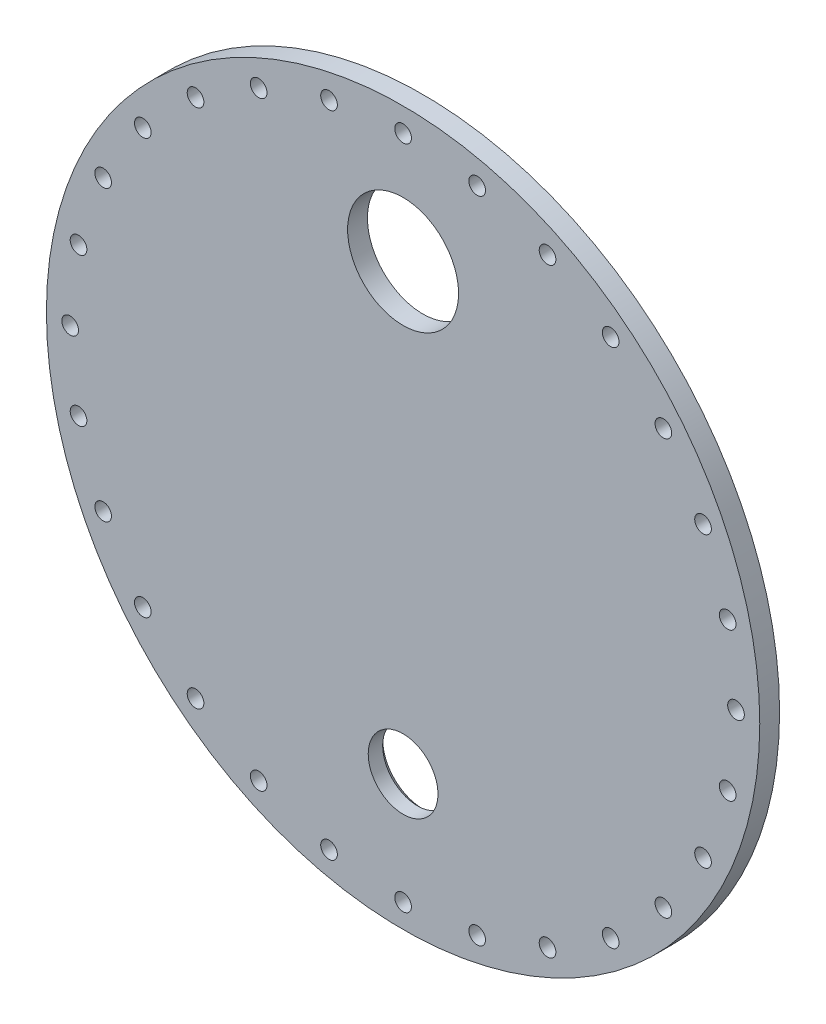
ISO-10303-21;
HEADER;
FILE_DESCRIPTION(('STEP AP214'),'2;1');
FILE_NAME('part.step','',(''),(''),'','','');
FILE_SCHEMA(('AUTOMOTIVE_DESIGN { 1 0 10303 214 1 1 1 1 }'));
ENDSEC;
DATA;
#1=APPLICATION_CONTEXT('core data for automotive mechanical design processes');
#2=APPLICATION_PROTOCOL_DEFINITION('international standard','automotive_design',2000,#1);
#3=PRODUCT_CONTEXT('',#1,'mechanical');
#4=PRODUCT('Part','Part','',(#3));
#5=PRODUCT_RELATED_PRODUCT_CATEGORY('part','',(#4));
#6=PRODUCT_DEFINITION_FORMATION('','',#4);
#7=PRODUCT_DEFINITION_CONTEXT('part definition',#1,'design');
#8=PRODUCT_DEFINITION('design','',#6,#7);
#9=PRODUCT_DEFINITION_SHAPE('','',#8);
#10=(LENGTH_UNIT() NAMED_UNIT(*) SI_UNIT(.MILLI.,.METRE.));
#11=(NAMED_UNIT(*) PLANE_ANGLE_UNIT() SI_UNIT($,.RADIAN.));
#12=(NAMED_UNIT(*) SI_UNIT($,.STERADIAN.) SOLID_ANGLE_UNIT());
#13=UNCERTAINTY_MEASURE_WITH_UNIT(LENGTH_MEASURE(1.E-05),#10,'distance_accuracy_value','');
#14=(GEOMETRIC_REPRESENTATION_CONTEXT(3) GLOBAL_UNCERTAINTY_ASSIGNED_CONTEXT((#13)) GLOBAL_UNIT_ASSIGNED_CONTEXT((#10,
#11,#12)) REPRESENTATION_CONTEXT('',''));
#15=CARTESIAN_POINT('',(0.,0.,0.));
#16=DIRECTION('',(0.,0.,1.));
#17=DIRECTION('',(1.,0.,0.));
#18=AXIS2_PLACEMENT_3D('',#15,#16,#17);
#19=CARTESIAN_POINT('',(0.,0.,12.5));
#20=DIRECTION('',(0.,0.,1.));
#21=DIRECTION('',(1.,0.,0.));
#22=AXIS2_PLACEMENT_3D('',#19,#20,#21);
#23=PLANE('',#22);
#24=CARTESIAN_POINT('',(0.,0.,12.5));
#25=DIRECTION('',(0.,0.,1.));
#26=DIRECTION('',(1.,0.,0.));
#27=AXIS2_PLACEMENT_3D('',#24,#25,#26);
#28=CIRCLE('',#27,225.);
#29=CARTESIAN_POINT('',(225.,0.,12.5));
#30=VERTEX_POINT('',#29);
#31=EDGE_CURVE('E10',#30,#30,#28,.T.);
#32=ORIENTED_EDGE('',*,*,#31,.T.);
#33=EDGE_LOOP('',(#32));
#34=FACE_BOUND('',#33,.T.);
#35=CARTESIAN_POINT('',(0.,210.,12.5));
#36=DIRECTION('',(0.,0.,1.));
#37=DIRECTION('',(1.,0.,0.));
#38=AXIS2_PLACEMENT_3D('',#35,#36,#37);
#39=CIRCLE('',#38,5.25);
#40=CARTESIAN_POINT('',(5.25,210.,12.5));
#41=VERTEX_POINT('',#40);
#42=EDGE_CURVE('E41',#41,#41,#39,.T.);
#43=ORIENTED_EDGE('',*,*,#42,.F.);
#44=EDGE_LOOP('',(#43));
#45=FACE_BOUND('',#44,.T.);
#46=CARTESIAN_POINT('',(-46.7293961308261,204.734861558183,12.5));
#47=DIRECTION('',(0.,0.,1.));
#48=DIRECTION('',(0.974927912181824,0.222520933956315,0.));
#49=AXIS2_PLACEMENT_3D('',#46,#47,#48);
#50=CIRCLE('',#49,5.25);
#51=CARTESIAN_POINT('',(-41.6110245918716,205.903096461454,12.5));
#52=VERTEX_POINT('',#51);
#53=EDGE_CURVE('E47',#52,#52,#50,.T.);
#54=ORIENTED_EDGE('',*,*,#53,.F.);
#55=EDGE_LOOP('',(#54));
#56=FACE_BOUND('',#55,.T.);
#57=CARTESIAN_POINT('',(-91.1155852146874,189.203462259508,12.5));
#58=DIRECTION('',(0.,0.,1.));
#59=DIRECTION('',(0.900968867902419,0.433883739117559,0.));
#60=AXIS2_PLACEMENT_3D('',#57,#58,#59);
#61=CIRCLE('',#60,5.25);
#62=CARTESIAN_POINT('',(-86.3854986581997,191.481351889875,12.5));
#63=VERTEX_POINT('',#62);
#64=EDGE_CURVE('E53',#63,#63,#61,.T.);
#65=ORIENTED_EDGE('',*,*,#64,.F.);
#66=EDGE_LOOP('',(#65));
#67=FACE_BOUND('',#66,.T.);
#68=CARTESIAN_POINT('',(-130.932858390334,164.184611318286,12.5));
#69=DIRECTION('',(0.,0.,1.));
#70=DIRECTION('',(0.781831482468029,0.623489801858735,0.));
#71=AXIS2_PLACEMENT_3D('',#68,#69,#70);
#72=CIRCLE('',#71,5.25);
#73=CARTESIAN_POINT('',(-126.828243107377,167.457932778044,12.5));
#74=VERTEX_POINT('',#73);
#75=EDGE_CURVE('E59',#74,#74,#72,.T.);
#76=ORIENTED_EDGE('',*,*,#75,.F.);
#77=EDGE_LOOP('',(#76));
#78=FACE_BOUND('',#77,.T.);
#79=CARTESIAN_POINT('',(-164.184611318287,130.932858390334,12.5));
#80=DIRECTION('',(0.,0.,1.));
#81=DIRECTION('',(0.623489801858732,0.781831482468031,0.));
#82=AXIS2_PLACEMENT_3D('',#79,#80,#81);
#83=CIRCLE('',#82,5.25);
#84=CARTESIAN_POINT('',(-160.911289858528,135.037473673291,12.5));
#85=VERTEX_POINT('',#84);
#86=EDGE_CURVE('E65',#85,#85,#83,.T.);
#87=ORIENTED_EDGE('',*,*,#86,.F.);
#88=EDGE_LOOP('',(#87));
#89=FACE_BOUND('',#88,.T.);
#90=CARTESIAN_POINT('',(-189.203462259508,91.1155852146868,12.5));
#91=DIRECTION('',(0.,0.,1.));
#92=DIRECTION('',(0.433883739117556,0.90096886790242,0.));
#93=AXIS2_PLACEMENT_3D('',#90,#91,#92);
#94=CIRCLE('',#93,5.25);
#95=CARTESIAN_POINT('',(-186.925572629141,95.8456717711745,12.5));
#96=VERTEX_POINT('',#95);
#97=EDGE_CURVE('E71',#96,#96,#94,.T.);
#98=ORIENTED_EDGE('',*,*,#97,.F.);
#99=EDGE_LOOP('',(#98));
#100=FACE_BOUND('',#99,.T.);
#101=CARTESIAN_POINT('',(-204.734861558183,46.7293961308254,12.5));
#102=DIRECTION('',(0.,0.,1.));
#103=DIRECTION('',(0.222520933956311,0.974927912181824,0.));
#104=AXIS2_PLACEMENT_3D('',#101,#102,#103);
#105=CIRCLE('',#104,5.25);
#106=CARTESIAN_POINT('',(-203.566626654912,51.84776766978,12.5));
#107=VERTEX_POINT('',#106);
#108=EDGE_CURVE('E77',#107,#107,#105,.T.);
#109=ORIENTED_EDGE('',*,*,#108,.F.);
#110=EDGE_LOOP('',(#109));
#111=FACE_BOUND('',#110,.T.);
#112=CARTESIAN_POINT('',(-210.,-7.33211081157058E-13,12.5));
#113=DIRECTION('',(0.,0.,1.));
#114=DIRECTION('',(0.,1.,0.));
#115=AXIS2_PLACEMENT_3D('',#112,#113,#114);
#116=CIRCLE('',#115,5.25);
#117=CARTESIAN_POINT('',(-210.,5.24999999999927,12.5));
#118=VERTEX_POINT('',#117);
#119=EDGE_CURVE('E83',#118,#118,#116,.T.);
#120=ORIENTED_EDGE('',*,*,#119,.F.);
#121=EDGE_LOOP('',(#120));
#122=FACE_BOUND('',#121,.T.);
#123=CARTESIAN_POINT('',(-204.734861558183,-46.7293961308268,12.5));
#124=DIRECTION('',(0.,0.,1.));
#125=DIRECTION('',(-0.222520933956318,0.974927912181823,0.));
#126=AXIS2_PLACEMENT_3D('',#123,#124,#125);
#127=CIRCLE('',#126,5.25);
#128=CARTESIAN_POINT('',(-205.903096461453,-41.6110245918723,12.5));
#129=VERTEX_POINT('',#128);
#130=EDGE_CURVE('E89',#129,#129,#127,.T.);
#131=ORIENTED_EDGE('',*,*,#130,.F.);
#132=EDGE_LOOP('',(#131));
#133=FACE_BOUND('',#132,.T.);
#134=CARTESIAN_POINT('',(-189.203462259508,-91.115585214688,12.5));
#135=DIRECTION('',(0.,0.,1.));
#136=DIRECTION('',(-0.433883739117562,0.900968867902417,0.));
#137=AXIS2_PLACEMENT_3D('',#134,#135,#136);
#138=CIRCLE('',#137,5.25);
#139=CARTESIAN_POINT('',(-191.481351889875,-86.3854986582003,12.5));
#140=VERTEX_POINT('',#139);
#141=EDGE_CURVE('E95',#140,#140,#138,.T.);
#142=ORIENTED_EDGE('',*,*,#141,.F.);
#143=EDGE_LOOP('',(#142));
#144=FACE_BOUND('',#143,.T.);
#145=CARTESIAN_POINT('',(-164.184611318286,-130.932858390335,12.5));
#146=DIRECTION('',(0.,0.,1.));
#147=DIRECTION('',(-0.623489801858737,0.781831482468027,0.));
#148=AXIS2_PLACEMENT_3D('',#145,#146,#147);
#149=CIRCLE('',#148,5.25);
#150=CARTESIAN_POINT('',(-167.457932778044,-126.828243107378,12.5));
#151=VERTEX_POINT('',#150);
#152=EDGE_CURVE('E101',#151,#151,#149,.T.);
#153=ORIENTED_EDGE('',*,*,#152,.F.);
#154=EDGE_LOOP('',(#153));
#155=FACE_BOUND('',#154,.T.);
#156=CARTESIAN_POINT('',(-130.932858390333,-164.184611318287,12.5));
#157=DIRECTION('',(0.,0.,1.));
#158=DIRECTION('',(-0.781831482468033,0.623489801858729,0.));
#159=AXIS2_PLACEMENT_3D('',#156,#157,#158);
#160=CIRCLE('',#159,5.25);
#161=CARTESIAN_POINT('',(-135.03747367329,-160.911289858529,12.5));
#162=VERTEX_POINT('',#161);
#163=EDGE_CURVE('E107',#162,#162,#160,.T.);
#164=ORIENTED_EDGE('',*,*,#163,.F.);
#165=EDGE_LOOP('',(#164));
#166=FACE_BOUND('',#165,.T.);
#167=CARTESIAN_POINT('',(-91.115585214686,-189.203462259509,12.5));
#168=DIRECTION('',(0.,0.,1.));
#169=DIRECTION('',(-0.900968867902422,0.433883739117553,0.));
#170=AXIS2_PLACEMENT_3D('',#167,#168,#169);
#171=CIRCLE('',#170,5.25);
#172=CARTESIAN_POINT('',(-95.8456717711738,-186.925572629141,12.5));
#173=VERTEX_POINT('',#172);
#174=EDGE_CURVE('E113',#173,#173,#171,.T.);
#175=ORIENTED_EDGE('',*,*,#174,.F.);
#176=EDGE_LOOP('',(#175));
#177=FACE_BOUND('',#176,.T.);
#178=CARTESIAN_POINT('',(-46.7293961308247,-204.734861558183,12.5));
#179=DIRECTION('',(0.,0.,1.));
#180=DIRECTION('',(-0.974927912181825,0.222520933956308,0.));
#181=AXIS2_PLACEMENT_3D('',#178,#179,#180);
#182=CIRCLE('',#181,5.25);
#183=CARTESIAN_POINT('',(-51.8477676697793,-203.566626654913,12.5));
#184=VERTEX_POINT('',#183);
#185=EDGE_CURVE('E119',#184,#184,#182,.T.);
#186=ORIENTED_EDGE('',*,*,#185,.F.);
#187=EDGE_LOOP('',(#186));
#188=FACE_BOUND('',#187,.T.);
#189=CARTESIAN_POINT('',(0.,-210.,12.5));
#190=DIRECTION('',(0.,0.,1.));
#191=DIRECTION('',(-1.,0.,0.));
#192=AXIS2_PLACEMENT_3D('',#189,#190,#191);
#193=CIRCLE('',#192,5.25);
#194=CARTESIAN_POINT('',(-5.25,-210.,12.5));
#195=VERTEX_POINT('',#194);
#196=EDGE_CURVE('E125',#195,#195,#193,.T.);
#197=ORIENTED_EDGE('',*,*,#196,.F.);
#198=EDGE_LOOP('',(#197));
#199=FACE_BOUND('',#198,.T.);
#200=CARTESIAN_POINT('',(46.7293961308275,-204.734861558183,12.5));
#201=DIRECTION('',(0.,0.,1.));
#202=DIRECTION('',(-0.974927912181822,-0.222520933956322,0.));
#203=AXIS2_PLACEMENT_3D('',#200,#201,#202);
#204=CIRCLE('',#203,5.25);
#205=CARTESIAN_POINT('',(41.611024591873,-205.903096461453,12.5));
#206=VERTEX_POINT('',#205);
#207=EDGE_CURVE('E131',#206,#206,#204,.T.);
#208=ORIENTED_EDGE('',*,*,#207,.F.);
#209=EDGE_LOOP('',(#208));
#210=FACE_BOUND('',#209,.T.);
#211=CARTESIAN_POINT('',(91.1155852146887,-189.203462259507,12.5));
#212=DIRECTION('',(0.,0.,1.));
#213=DIRECTION('',(-0.900968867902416,-0.433883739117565,0.));
#214=AXIS2_PLACEMENT_3D('',#211,#212,#213);
#215=CIRCLE('',#214,5.25);
#216=CARTESIAN_POINT('',(86.385498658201,-191.481351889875,12.5));
#217=VERTEX_POINT('',#216);
#218=EDGE_CURVE('E137',#217,#217,#215,.T.);
#219=ORIENTED_EDGE('',*,*,#218,.F.);
#220=EDGE_LOOP('',(#219));
#221=FACE_BOUND('',#220,.T.);
#222=CARTESIAN_POINT('',(130.932858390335,-164.184611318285,12.5));
#223=DIRECTION('',(0.,0.,1.));
#224=DIRECTION('',(-0.781831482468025,-0.62348980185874,0.));
#225=AXIS2_PLACEMENT_3D('',#222,#223,#224);
#226=CIRCLE('',#225,5.25);
#227=CARTESIAN_POINT('',(126.828243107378,-167.457932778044,12.5));
#228=VERTEX_POINT('',#227);
#229=EDGE_CURVE('E143',#228,#228,#226,.T.);
#230=ORIENTED_EDGE('',*,*,#229,.F.);
#231=EDGE_LOOP('',(#230));
#232=FACE_BOUND('',#231,.T.);
#233=CARTESIAN_POINT('',(164.184611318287,-130.932858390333,12.5));
#234=DIRECTION('',(0.,0.,1.));
#235=DIRECTION('',(-0.623489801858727,-0.781831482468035,0.));
#236=AXIS2_PLACEMENT_3D('',#233,#234,#235);
#237=CIRCLE('',#236,5.25);
#238=CARTESIAN_POINT('',(160.911289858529,-135.03747367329,12.5));
#239=VERTEX_POINT('',#238);
#240=EDGE_CURVE('E149',#239,#239,#237,.T.);
#241=ORIENTED_EDGE('',*,*,#240,.F.);
#242=EDGE_LOOP('',(#241));
#243=FACE_BOUND('',#242,.T.);
#244=CARTESIAN_POINT('',(189.203462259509,-91.1155852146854,12.5));
#245=DIRECTION('',(0.,0.,1.));
#246=DIRECTION('',(-0.433883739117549,-0.900968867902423,0.));
#247=AXIS2_PLACEMENT_3D('',#244,#245,#246);
#248=CIRCLE('',#247,5.25);
#249=CARTESIAN_POINT('',(186.925572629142,-95.8456717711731,12.5));
#250=VERTEX_POINT('',#249);
#251=EDGE_CURVE('E155',#250,#250,#248,.T.);
#252=ORIENTED_EDGE('',*,*,#251,.F.);
#253=EDGE_LOOP('',(#252));
#254=FACE_BOUND('',#253,.T.);
#255=CARTESIAN_POINT('',(204.734861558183,-46.7293961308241,12.5));
#256=DIRECTION('',(0.,0.,1.));
#257=DIRECTION('',(-0.222520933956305,-0.974927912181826,0.));
#258=AXIS2_PLACEMENT_3D('',#255,#256,#257);
#259=CIRCLE('',#258,5.25);
#260=CARTESIAN_POINT('',(203.566626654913,-51.8477676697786,12.5));
#261=VERTEX_POINT('',#260);
#262=EDGE_CURVE('E161',#261,#261,#259,.T.);
#263=ORIENTED_EDGE('',*,*,#262,.F.);
#264=EDGE_LOOP('',(#263));
#265=FACE_BOUND('',#264,.T.);
#266=CARTESIAN_POINT('',(210.,2.19963324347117E-12,12.5));
#267=DIRECTION('',(0.,0.,1.));
#268=DIRECTION('',(0.,-1.,0.));
#269=AXIS2_PLACEMENT_3D('',#266,#267,#268);
#270=CIRCLE('',#269,5.25);
#271=CARTESIAN_POINT('',(210.,-5.2499999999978,12.5));
#272=VERTEX_POINT('',#271);
#273=EDGE_CURVE('E167',#272,#272,#270,.T.);
#274=ORIENTED_EDGE('',*,*,#273,.F.);
#275=EDGE_LOOP('',(#274));
#276=FACE_BOUND('',#275,.T.);
#277=CARTESIAN_POINT('',(204.734861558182,46.7293961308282,12.5));
#278=DIRECTION('',(0.,0.,1.));
#279=DIRECTION('',(0.222520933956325,-0.974927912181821,0.));
#280=AXIS2_PLACEMENT_3D('',#277,#278,#279);
#281=CIRCLE('',#280,5.25);
#282=CARTESIAN_POINT('',(205.903096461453,41.6110245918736,12.5));
#283=VERTEX_POINT('',#282);
#284=EDGE_CURVE('E173',#283,#283,#281,.T.);
#285=ORIENTED_EDGE('',*,*,#284,.F.);
#286=EDGE_LOOP('',(#285));
#287=FACE_BOUND('',#286,.T.);
#288=CARTESIAN_POINT('',(189.203462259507,91.1155852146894,12.5));
#289=DIRECTION('',(0.,0.,1.));
#290=DIRECTION('',(0.433883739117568,-0.900968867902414,0.));
#291=AXIS2_PLACEMENT_3D('',#288,#289,#290);
#292=CIRCLE('',#291,5.25);
#293=CARTESIAN_POINT('',(191.481351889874,86.3854986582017,12.5));
#294=VERTEX_POINT('',#293);
#295=EDGE_CURVE('E179',#294,#294,#292,.T.);
#296=ORIENTED_EDGE('',*,*,#295,.F.);
#297=EDGE_LOOP('',(#296));
#298=FACE_BOUND('',#297,.T.);
#299=CARTESIAN_POINT('',(164.184611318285,130.932858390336,12.5));
#300=DIRECTION('',(0.,0.,1.));
#301=DIRECTION('',(0.623489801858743,-0.781831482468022,0.));
#302=AXIS2_PLACEMENT_3D('',#299,#300,#301);
#303=CIRCLE('',#302,5.25);
#304=CARTESIAN_POINT('',(167.457932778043,126.828243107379,12.5));
#305=VERTEX_POINT('',#304);
#306=EDGE_CURVE('E185',#305,#305,#303,.T.);
#307=ORIENTED_EDGE('',*,*,#306,.F.);
#308=EDGE_LOOP('',(#307));
#309=FACE_BOUND('',#308,.T.);
#310=CARTESIAN_POINT('',(130.932858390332,164.184611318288,12.5));
#311=DIRECTION('',(0.,0.,1.));
#312=DIRECTION('',(0.781831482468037,-0.623489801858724,0.));
#313=AXIS2_PLACEMENT_3D('',#310,#311,#312);
#314=CIRCLE('',#313,5.25);
#315=CARTESIAN_POINT('',(135.037473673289,160.91128985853,12.5));
#316=VERTEX_POINT('',#315);
#317=EDGE_CURVE('E191',#316,#316,#314,.T.);
#318=ORIENTED_EDGE('',*,*,#317,.F.);
#319=EDGE_LOOP('',(#318));
#320=FACE_BOUND('',#319,.T.);
#321=CARTESIAN_POINT('',(91.1155852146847,189.203462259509,12.5));
#322=DIRECTION('',(0.,0.,1.));
#323=DIRECTION('',(0.900968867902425,-0.433883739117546,0.));
#324=AXIS2_PLACEMENT_3D('',#321,#322,#323);
#325=CIRCLE('',#324,5.25);
#326=CARTESIAN_POINT('',(95.8456717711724,186.925572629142,12.5));
#327=VERTEX_POINT('',#326);
#328=EDGE_CURVE('E197',#327,#327,#325,.T.);
#329=ORIENTED_EDGE('',*,*,#328,.F.);
#330=EDGE_LOOP('',(#329));
#331=FACE_BOUND('',#330,.T.);
#332=CARTESIAN_POINT('',(46.7293961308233,204.734861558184,12.5));
#333=DIRECTION('',(0.,0.,1.));
#334=DIRECTION('',(0.974927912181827,-0.222520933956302,0.));
#335=AXIS2_PLACEMENT_3D('',#332,#333,#334);
#336=CIRCLE('',#335,5.25);
#337=CARTESIAN_POINT('',(51.8477676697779,203.566626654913,12.5));
#338=VERTEX_POINT('',#337);
#339=EDGE_CURVE('E203',#338,#338,#336,.T.);
#340=ORIENTED_EDGE('',*,*,#339,.F.);
#341=EDGE_LOOP('',(#340));
#342=FACE_BOUND('',#341,.T.);
#343=CARTESIAN_POINT('',(0.,140.,12.5));
#344=DIRECTION('',(0.,0.,1.));
#345=DIRECTION('',(1.,0.,0.));
#346=AXIS2_PLACEMENT_3D('',#343,#344,#345);
#347=CIRCLE('',#346,35.);
#348=CARTESIAN_POINT('',(35.,140.,12.5));
#349=VERTEX_POINT('',#348);
#350=EDGE_CURVE('E209',#349,#349,#347,.T.);
#351=ORIENTED_EDGE('',*,*,#350,.F.);
#352=EDGE_LOOP('',(#351));
#353=FACE_BOUND('',#352,.T.);
#354=CARTESIAN_POINT('',(0.,-140.,12.5));
#355=DIRECTION('',(0.,0.,-1.));
#356=DIRECTION('',(-1.,0.,0.));
#357=AXIS2_PLACEMENT_3D('',#354,#355,#356);
#358=CIRCLE('',#357,22.);
#359=CARTESIAN_POINT('',(-22.,-140.,12.5));
#360=VERTEX_POINT('',#359);
#361=EDGE_CURVE('E212',#360,#360,#358,.T.);
#362=ORIENTED_EDGE('',*,*,#361,.T.);
#363=EDGE_LOOP('',(#362));
#364=FACE_BOUND('',#363,.T.);
#365=ADVANCED_FACE('F28',(#34,#45,#56,#67,#78,#89,#100,#111,#122,#133,#144,#155,#166,#177,#188,
#199,#210,#221,#232,#243,#254,#265,#276,#287,#298,#309,#320,#331,#342,#353,#364),#23,.T.);
#366=CARTESIAN_POINT('',(0.,0.,12.5));
#367=DIRECTION('',(0.,0.,-1.));
#368=DIRECTION('',(-1.,0.,0.));
#369=AXIS2_PLACEMENT_3D('',#366,#367,#368);
#370=CYLINDRICAL_SURFACE('',#369,225.);
#371=ORIENTED_EDGE('',*,*,#31,.F.);
#372=EDGE_LOOP('',(#371));
#373=FACE_BOUND('',#372,.T.);
#374=CARTESIAN_POINT('',(0.,0.,0.));
#375=DIRECTION('',(0.,0.,1.));
#376=DIRECTION('',(1.,0.,0.));
#377=AXIS2_PLACEMENT_3D('',#374,#375,#376);
#378=CIRCLE('',#377,225.);
#379=CARTESIAN_POINT('',(225.,0.,0.));
#380=VERTEX_POINT('',#379);
#381=EDGE_CURVE('E32',#380,#380,#378,.T.);
#382=ORIENTED_EDGE('',*,*,#381,.T.);
#383=EDGE_LOOP('',(#382));
#384=FACE_BOUND('',#383,.T.);
#385=ADVANCED_FACE('F30',(#373,#384),#370,.T.);
#386=CARTESIAN_POINT('',(0.,0.,0.));
#387=DIRECTION('',(0.,0.,1.));
#388=DIRECTION('',(1.,0.,0.));
#389=AXIS2_PLACEMENT_3D('',#386,#387,#388);
#390=PLANE('',#389);
#391=CARTESIAN_POINT('',(0.,-140.,0.));
#392=DIRECTION('',(0.,0.,-1.));
#393=DIRECTION('',(-1.,0.,0.));
#394=AXIS2_PLACEMENT_3D('',#391,#392,#393);
#395=CIRCLE('',#394,25.4);
#396=CARTESIAN_POINT('',(-25.4,-140.,0.));
#397=VERTEX_POINT('',#396);
#398=EDGE_CURVE('E220',#397,#397,#395,.T.);
#399=ORIENTED_EDGE('',*,*,#398,.F.);
#400=EDGE_LOOP('',(#399));
#401=FACE_BOUND('',#400,.T.);
#402=CARTESIAN_POINT('',(0.,140.,0.));
#403=DIRECTION('',(0.,0.,1.));
#404=DIRECTION('',(1.,0.,0.));
#405=AXIS2_PLACEMENT_3D('',#402,#403,#404);
#406=CIRCLE('',#405,35.);
#407=CARTESIAN_POINT('',(35.,140.,0.));
#408=VERTEX_POINT('',#407);
#409=EDGE_CURVE('E206',#408,#408,#406,.T.);
#410=ORIENTED_EDGE('',*,*,#409,.T.);
#411=EDGE_LOOP('',(#410));
#412=FACE_BOUND('',#411,.T.);
#413=CARTESIAN_POINT('',(46.7293961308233,204.734861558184,0.));
#414=DIRECTION('',(0.,0.,1.));
#415=DIRECTION('',(0.974927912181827,-0.222520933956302,0.));
#416=AXIS2_PLACEMENT_3D('',#413,#414,#415);
#417=CIRCLE('',#416,5.25);
#418=CARTESIAN_POINT('',(51.8477676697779,203.566626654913,0.));
#419=VERTEX_POINT('',#418);
#420=EDGE_CURVE('E200',#419,#419,#417,.T.);
#421=ORIENTED_EDGE('',*,*,#420,.T.);
#422=EDGE_LOOP('',(#421));
#423=FACE_BOUND('',#422,.T.);
#424=CARTESIAN_POINT('',(91.1155852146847,189.203462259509,0.));
#425=DIRECTION('',(0.,0.,1.));
#426=DIRECTION('',(0.900968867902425,-0.433883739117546,0.));
#427=AXIS2_PLACEMENT_3D('',#424,#425,#426);
#428=CIRCLE('',#427,5.25);
#429=CARTESIAN_POINT('',(95.8456717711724,186.925572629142,0.));
#430=VERTEX_POINT('',#429);
#431=EDGE_CURVE('E194',#430,#430,#428,.T.);
#432=ORIENTED_EDGE('',*,*,#431,.T.);
#433=EDGE_LOOP('',(#432));
#434=FACE_BOUND('',#433,.T.);
#435=CARTESIAN_POINT('',(130.932858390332,164.184611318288,0.));
#436=DIRECTION('',(0.,0.,1.));
#437=DIRECTION('',(0.781831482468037,-0.623489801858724,0.));
#438=AXIS2_PLACEMENT_3D('',#435,#436,#437);
#439=CIRCLE('',#438,5.25);
#440=CARTESIAN_POINT('',(135.037473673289,160.91128985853,0.));
#441=VERTEX_POINT('',#440);
#442=EDGE_CURVE('E188',#441,#441,#439,.T.);
#443=ORIENTED_EDGE('',*,*,#442,.T.);
#444=EDGE_LOOP('',(#443));
#445=FACE_BOUND('',#444,.T.);
#446=CARTESIAN_POINT('',(164.184611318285,130.932858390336,0.));
#447=DIRECTION('',(0.,0.,1.));
#448=DIRECTION('',(0.623489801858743,-0.781831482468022,0.));
#449=AXIS2_PLACEMENT_3D('',#446,#447,#448);
#450=CIRCLE('',#449,5.25);
#451=CARTESIAN_POINT('',(167.457932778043,126.828243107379,0.));
#452=VERTEX_POINT('',#451);
#453=EDGE_CURVE('E182',#452,#452,#450,.T.);
#454=ORIENTED_EDGE('',*,*,#453,.T.);
#455=EDGE_LOOP('',(#454));
#456=FACE_BOUND('',#455,.T.);
#457=CARTESIAN_POINT('',(189.203462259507,91.1155852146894,0.));
#458=DIRECTION('',(0.,0.,1.));
#459=DIRECTION('',(0.433883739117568,-0.900968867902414,0.));
#460=AXIS2_PLACEMENT_3D('',#457,#458,#459);
#461=CIRCLE('',#460,5.25);
#462=CARTESIAN_POINT('',(191.481351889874,86.3854986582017,0.));
#463=VERTEX_POINT('',#462);
#464=EDGE_CURVE('E176',#463,#463,#461,.T.);
#465=ORIENTED_EDGE('',*,*,#464,.T.);
#466=EDGE_LOOP('',(#465));
#467=FACE_BOUND('',#466,.T.);
#468=CARTESIAN_POINT('',(204.734861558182,46.7293961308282,0.));
#469=DIRECTION('',(0.,0.,1.));
#470=DIRECTION('',(0.222520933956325,-0.974927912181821,0.));
#471=AXIS2_PLACEMENT_3D('',#468,#469,#470);
#472=CIRCLE('',#471,5.25);
#473=CARTESIAN_POINT('',(205.903096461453,41.6110245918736,0.));
#474=VERTEX_POINT('',#473);
#475=EDGE_CURVE('E170',#474,#474,#472,.T.);
#476=ORIENTED_EDGE('',*,*,#475,.T.);
#477=EDGE_LOOP('',(#476));
#478=FACE_BOUND('',#477,.T.);
#479=CARTESIAN_POINT('',(210.,2.19963324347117E-12,0.));
#480=DIRECTION('',(0.,0.,1.));
#481=DIRECTION('',(0.,-1.,0.));
#482=AXIS2_PLACEMENT_3D('',#479,#480,#481);
#483=CIRCLE('',#482,5.25);
#484=CARTESIAN_POINT('',(210.,-5.2499999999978,0.));
#485=VERTEX_POINT('',#484);
#486=EDGE_CURVE('E164',#485,#485,#483,.T.);
#487=ORIENTED_EDGE('',*,*,#486,.T.);
#488=EDGE_LOOP('',(#487));
#489=FACE_BOUND('',#488,.T.);
#490=CARTESIAN_POINT('',(204.734861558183,-46.7293961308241,0.));
#491=DIRECTION('',(0.,0.,1.));
#492=DIRECTION('',(-0.222520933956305,-0.974927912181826,0.));
#493=AXIS2_PLACEMENT_3D('',#490,#491,#492);
#494=CIRCLE('',#493,5.25);
#495=CARTESIAN_POINT('',(203.566626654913,-51.8477676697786,0.));
#496=VERTEX_POINT('',#495);
#497=EDGE_CURVE('E158',#496,#496,#494,.T.);
#498=ORIENTED_EDGE('',*,*,#497,.T.);
#499=EDGE_LOOP('',(#498));
#500=FACE_BOUND('',#499,.T.);
#501=CARTESIAN_POINT('',(189.203462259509,-91.1155852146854,0.));
#502=DIRECTION('',(0.,0.,1.));
#503=DIRECTION('',(-0.433883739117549,-0.900968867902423,0.));
#504=AXIS2_PLACEMENT_3D('',#501,#502,#503);
#505=CIRCLE('',#504,5.25);
#506=CARTESIAN_POINT('',(186.925572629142,-95.8456717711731,0.));
#507=VERTEX_POINT('',#506);
#508=EDGE_CURVE('E152',#507,#507,#505,.T.);
#509=ORIENTED_EDGE('',*,*,#508,.T.);
#510=EDGE_LOOP('',(#509));
#511=FACE_BOUND('',#510,.T.);
#512=CARTESIAN_POINT('',(164.184611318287,-130.932858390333,0.));
#513=DIRECTION('',(0.,0.,1.));
#514=DIRECTION('',(-0.623489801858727,-0.781831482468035,0.));
#515=AXIS2_PLACEMENT_3D('',#512,#513,#514);
#516=CIRCLE('',#515,5.25);
#517=CARTESIAN_POINT('',(160.911289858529,-135.03747367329,0.));
#518=VERTEX_POINT('',#517);
#519=EDGE_CURVE('E146',#518,#518,#516,.T.);
#520=ORIENTED_EDGE('',*,*,#519,.T.);
#521=EDGE_LOOP('',(#520));
#522=FACE_BOUND('',#521,.T.);
#523=CARTESIAN_POINT('',(130.932858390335,-164.184611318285,0.));
#524=DIRECTION('',(0.,0.,1.));
#525=DIRECTION('',(-0.781831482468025,-0.62348980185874,0.));
#526=AXIS2_PLACEMENT_3D('',#523,#524,#525);
#527=CIRCLE('',#526,5.25);
#528=CARTESIAN_POINT('',(126.828243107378,-167.457932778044,0.));
#529=VERTEX_POINT('',#528);
#530=EDGE_CURVE('E140',#529,#529,#527,.T.);
#531=ORIENTED_EDGE('',*,*,#530,.T.);
#532=EDGE_LOOP('',(#531));
#533=FACE_BOUND('',#532,.T.);
#534=CARTESIAN_POINT('',(91.1155852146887,-189.203462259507,0.));
#535=DIRECTION('',(0.,0.,1.));
#536=DIRECTION('',(-0.900968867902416,-0.433883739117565,0.));
#537=AXIS2_PLACEMENT_3D('',#534,#535,#536);
#538=CIRCLE('',#537,5.25);
#539=CARTESIAN_POINT('',(86.385498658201,-191.481351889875,0.));
#540=VERTEX_POINT('',#539);
#541=EDGE_CURVE('E134',#540,#540,#538,.T.);
#542=ORIENTED_EDGE('',*,*,#541,.T.);
#543=EDGE_LOOP('',(#542));
#544=FACE_BOUND('',#543,.T.);
#545=CARTESIAN_POINT('',(46.7293961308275,-204.734861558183,0.));
#546=DIRECTION('',(0.,0.,1.));
#547=DIRECTION('',(-0.974927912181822,-0.222520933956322,0.));
#548=AXIS2_PLACEMENT_3D('',#545,#546,#547);
#549=CIRCLE('',#548,5.25);
#550=CARTESIAN_POINT('',(41.611024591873,-205.903096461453,0.));
#551=VERTEX_POINT('',#550);
#552=EDGE_CURVE('E128',#551,#551,#549,.T.);
#553=ORIENTED_EDGE('',*,*,#552,.T.);
#554=EDGE_LOOP('',(#553));
#555=FACE_BOUND('',#554,.T.);
#556=CARTESIAN_POINT('',(0.,-210.,0.));
#557=DIRECTION('',(0.,0.,1.));
#558=DIRECTION('',(-1.,0.,0.));
#559=AXIS2_PLACEMENT_3D('',#556,#557,#558);
#560=CIRCLE('',#559,5.25);
#561=CARTESIAN_POINT('',(-5.25,-210.,0.));
#562=VERTEX_POINT('',#561);
#563=EDGE_CURVE('E122',#562,#562,#560,.T.);
#564=ORIENTED_EDGE('',*,*,#563,.T.);
#565=EDGE_LOOP('',(#564));
#566=FACE_BOUND('',#565,.T.);
#567=CARTESIAN_POINT('',(-46.7293961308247,-204.734861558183,0.));
#568=DIRECTION('',(0.,0.,1.));
#569=DIRECTION('',(-0.974927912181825,0.222520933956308,0.));
#570=AXIS2_PLACEMENT_3D('',#567,#568,#569);
#571=CIRCLE('',#570,5.25);
#572=CARTESIAN_POINT('',(-51.8477676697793,-203.566626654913,0.));
#573=VERTEX_POINT('',#572);
#574=EDGE_CURVE('E116',#573,#573,#571,.T.);
#575=ORIENTED_EDGE('',*,*,#574,.T.);
#576=EDGE_LOOP('',(#575));
#577=FACE_BOUND('',#576,.T.);
#578=CARTESIAN_POINT('',(-91.115585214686,-189.203462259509,0.));
#579=DIRECTION('',(0.,0.,1.));
#580=DIRECTION('',(-0.900968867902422,0.433883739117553,0.));
#581=AXIS2_PLACEMENT_3D('',#578,#579,#580);
#582=CIRCLE('',#581,5.25);
#583=CARTESIAN_POINT('',(-95.8456717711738,-186.925572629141,0.));
#584=VERTEX_POINT('',#583);
#585=EDGE_CURVE('E110',#584,#584,#582,.T.);
#586=ORIENTED_EDGE('',*,*,#585,.T.);
#587=EDGE_LOOP('',(#586));
#588=FACE_BOUND('',#587,.T.);
#589=CARTESIAN_POINT('',(-130.932858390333,-164.184611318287,0.));
#590=DIRECTION('',(0.,0.,1.));
#591=DIRECTION('',(-0.781831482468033,0.623489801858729,0.));
#592=AXIS2_PLACEMENT_3D('',#589,#590,#591);
#593=CIRCLE('',#592,5.25);
#594=CARTESIAN_POINT('',(-135.03747367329,-160.911289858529,0.));
#595=VERTEX_POINT('',#594);
#596=EDGE_CURVE('E104',#595,#595,#593,.T.);
#597=ORIENTED_EDGE('',*,*,#596,.T.);
#598=EDGE_LOOP('',(#597));
#599=FACE_BOUND('',#598,.T.);
#600=CARTESIAN_POINT('',(-164.184611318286,-130.932858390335,0.));
#601=DIRECTION('',(0.,0.,1.));
#602=DIRECTION('',(-0.623489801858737,0.781831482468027,0.));
#603=AXIS2_PLACEMENT_3D('',#600,#601,#602);
#604=CIRCLE('',#603,5.25);
#605=CARTESIAN_POINT('',(-167.457932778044,-126.828243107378,0.));
#606=VERTEX_POINT('',#605);
#607=EDGE_CURVE('E98',#606,#606,#604,.T.);
#608=ORIENTED_EDGE('',*,*,#607,.T.);
#609=EDGE_LOOP('',(#608));
#610=FACE_BOUND('',#609,.T.);
#611=CARTESIAN_POINT('',(-189.203462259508,-91.115585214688,0.));
#612=DIRECTION('',(0.,0.,1.));
#613=DIRECTION('',(-0.433883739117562,0.900968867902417,0.));
#614=AXIS2_PLACEMENT_3D('',#611,#612,#613);
#615=CIRCLE('',#614,5.25);
#616=CARTESIAN_POINT('',(-191.481351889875,-86.3854986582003,0.));
#617=VERTEX_POINT('',#616);
#618=EDGE_CURVE('E92',#617,#617,#615,.T.);
#619=ORIENTED_EDGE('',*,*,#618,.T.);
#620=EDGE_LOOP('',(#619));
#621=FACE_BOUND('',#620,.T.);
#622=CARTESIAN_POINT('',(-204.734861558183,-46.7293961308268,0.));
#623=DIRECTION('',(0.,0.,1.));
#624=DIRECTION('',(-0.222520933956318,0.974927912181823,0.));
#625=AXIS2_PLACEMENT_3D('',#622,#623,#624);
#626=CIRCLE('',#625,5.25);
#627=CARTESIAN_POINT('',(-205.903096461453,-41.6110245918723,0.));
#628=VERTEX_POINT('',#627);
#629=EDGE_CURVE('E86',#628,#628,#626,.T.);
#630=ORIENTED_EDGE('',*,*,#629,.T.);
#631=EDGE_LOOP('',(#630));
#632=FACE_BOUND('',#631,.T.);
#633=CARTESIAN_POINT('',(-210.,-7.33211081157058E-13,0.));
#634=DIRECTION('',(0.,0.,1.));
#635=DIRECTION('',(0.,1.,0.));
#636=AXIS2_PLACEMENT_3D('',#633,#634,#635);
#637=CIRCLE('',#636,5.25);
#638=CARTESIAN_POINT('',(-210.,5.24999999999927,0.));
#639=VERTEX_POINT('',#638);
#640=EDGE_CURVE('E80',#639,#639,#637,.T.);
#641=ORIENTED_EDGE('',*,*,#640,.T.);
#642=EDGE_LOOP('',(#641));
#643=FACE_BOUND('',#642,.T.);
#644=CARTESIAN_POINT('',(-204.734861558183,46.7293961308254,0.));
#645=DIRECTION('',(0.,0.,1.));
#646=DIRECTION('',(0.222520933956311,0.974927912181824,0.));
#647=AXIS2_PLACEMENT_3D('',#644,#645,#646);
#648=CIRCLE('',#647,5.25);
#649=CARTESIAN_POINT('',(-203.566626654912,51.84776766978,0.));
#650=VERTEX_POINT('',#649);
#651=EDGE_CURVE('E74',#650,#650,#648,.T.);
#652=ORIENTED_EDGE('',*,*,#651,.T.);
#653=EDGE_LOOP('',(#652));
#654=FACE_BOUND('',#653,.T.);
#655=CARTESIAN_POINT('',(-189.203462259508,91.1155852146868,0.));
#656=DIRECTION('',(0.,0.,1.));
#657=DIRECTION('',(0.433883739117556,0.90096886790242,0.));
#658=AXIS2_PLACEMENT_3D('',#655,#656,#657);
#659=CIRCLE('',#658,5.25);
#660=CARTESIAN_POINT('',(-186.925572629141,95.8456717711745,0.));
#661=VERTEX_POINT('',#660);
#662=EDGE_CURVE('E68',#661,#661,#659,.T.);
#663=ORIENTED_EDGE('',*,*,#662,.T.);
#664=EDGE_LOOP('',(#663));
#665=FACE_BOUND('',#664,.T.);
#666=CARTESIAN_POINT('',(-164.184611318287,130.932858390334,0.));
#667=DIRECTION('',(0.,0.,1.));
#668=DIRECTION('',(0.623489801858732,0.781831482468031,0.));
#669=AXIS2_PLACEMENT_3D('',#666,#667,#668);
#670=CIRCLE('',#669,5.25);
#671=CARTESIAN_POINT('',(-160.911289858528,135.037473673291,0.));
#672=VERTEX_POINT('',#671);
#673=EDGE_CURVE('E62',#672,#672,#670,.T.);
#674=ORIENTED_EDGE('',*,*,#673,.T.);
#675=EDGE_LOOP('',(#674));
#676=FACE_BOUND('',#675,.T.);
#677=CARTESIAN_POINT('',(-130.932858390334,164.184611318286,0.));
#678=DIRECTION('',(0.,0.,1.));
#679=DIRECTION('',(0.781831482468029,0.623489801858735,0.));
#680=AXIS2_PLACEMENT_3D('',#677,#678,#679);
#681=CIRCLE('',#680,5.25);
#682=CARTESIAN_POINT('',(-126.828243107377,167.457932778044,0.));
#683=VERTEX_POINT('',#682);
#684=EDGE_CURVE('E56',#683,#683,#681,.T.);
#685=ORIENTED_EDGE('',*,*,#684,.T.);
#686=EDGE_LOOP('',(#685));
#687=FACE_BOUND('',#686,.T.);
#688=CARTESIAN_POINT('',(-91.1155852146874,189.203462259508,0.));
#689=DIRECTION('',(0.,0.,1.));
#690=DIRECTION('',(0.900968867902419,0.433883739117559,0.));
#691=AXIS2_PLACEMENT_3D('',#688,#689,#690);
#692=CIRCLE('',#691,5.25);
#693=CARTESIAN_POINT('',(-86.3854986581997,191.481351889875,0.));
#694=VERTEX_POINT('',#693);
#695=EDGE_CURVE('E50',#694,#694,#692,.T.);
#696=ORIENTED_EDGE('',*,*,#695,.T.);
#697=EDGE_LOOP('',(#696));
#698=FACE_BOUND('',#697,.T.);
#699=CARTESIAN_POINT('',(-46.7293961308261,204.734861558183,0.));
#700=DIRECTION('',(0.,0.,1.));
#701=DIRECTION('',(0.974927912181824,0.222520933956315,0.));
#702=AXIS2_PLACEMENT_3D('',#699,#700,#701);
#703=CIRCLE('',#702,5.25);
#704=CARTESIAN_POINT('',(-41.6110245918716,205.903096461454,0.));
#705=VERTEX_POINT('',#704);
#706=EDGE_CURVE('E44',#705,#705,#703,.T.);
#707=ORIENTED_EDGE('',*,*,#706,.T.);
#708=EDGE_LOOP('',(#707));
#709=FACE_BOUND('',#708,.T.);
#710=CARTESIAN_POINT('',(0.,210.,0.));
#711=DIRECTION('',(0.,0.,1.));
#712=DIRECTION('',(1.,0.,0.));
#713=AXIS2_PLACEMENT_3D('',#710,#711,#712);
#714=CIRCLE('',#713,5.25);
#715=CARTESIAN_POINT('',(5.25,210.,0.));
#716=VERTEX_POINT('',#715);
#717=EDGE_CURVE('E39',#716,#716,#714,.T.);
#718=ORIENTED_EDGE('',*,*,#717,.T.);
#719=EDGE_LOOP('',(#718));
#720=FACE_BOUND('',#719,.T.);
#721=ORIENTED_EDGE('',*,*,#381,.F.);
#722=EDGE_LOOP('',(#721));
#723=FACE_BOUND('',#722,.T.);
#724=ADVANCED_FACE('F226',(#401,#412,#423,#434,#445,#456,#467,#478,#489,#500,#511,#522,#533,
#544,#555,#566,#577,#588,#599,#610,#621,#632,#643,#654,#665,#676,#687,#698,#709,#720,#723),#390,.F.);
#725=CARTESIAN_POINT('',(0.,210.,0.));
#726=DIRECTION('',(0.,0.,1.));
#727=DIRECTION('',(1.,0.,0.));
#728=AXIS2_PLACEMENT_3D('',#725,#726,#727);
#729=CYLINDRICAL_SURFACE('',#728,5.25);
#730=ORIENTED_EDGE('',*,*,#717,.F.);
#731=EDGE_LOOP('',(#730));
#732=FACE_BOUND('',#731,.T.);
#733=ORIENTED_EDGE('',*,*,#42,.T.);
#734=EDGE_LOOP('',(#733));
#735=FACE_BOUND('',#734,.T.);
#736=ADVANCED_FACE('F229',(#732,#735),#729,.F.);
#737=CARTESIAN_POINT('',(-46.7293961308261,204.734861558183,0.));
#738=DIRECTION('',(0.,0.,1.));
#739=DIRECTION('',(1.,0.,0.));
#740=AXIS2_PLACEMENT_3D('',#737,#738,#739);
#741=CYLINDRICAL_SURFACE('',#740,5.25);
#742=ORIENTED_EDGE('',*,*,#706,.F.);
#743=EDGE_LOOP('',(#742));
#744=FACE_BOUND('',#743,.T.);
#745=ORIENTED_EDGE('',*,*,#53,.T.);
#746=EDGE_LOOP('',(#745));
#747=FACE_BOUND('',#746,.T.);
#748=ADVANCED_FACE('F302',(#744,#747),#741,.F.);
#749=CARTESIAN_POINT('',(-91.1155852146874,189.203462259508,0.));
#750=DIRECTION('',(0.,0.,1.));
#751=DIRECTION('',(1.,0.,0.));
#752=AXIS2_PLACEMENT_3D('',#749,#750,#751);
#753=CYLINDRICAL_SURFACE('',#752,5.25);
#754=ORIENTED_EDGE('',*,*,#695,.F.);
#755=EDGE_LOOP('',(#754));
#756=FACE_BOUND('',#755,.T.);
#757=ORIENTED_EDGE('',*,*,#64,.T.);
#758=EDGE_LOOP('',(#757));
#759=FACE_BOUND('',#758,.T.);
#760=ADVANCED_FACE('F306',(#756,#759),#753,.F.);
#761=CARTESIAN_POINT('',(-130.932858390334,164.184611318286,0.));
#762=DIRECTION('',(0.,0.,1.));
#763=DIRECTION('',(1.,0.,0.));
#764=AXIS2_PLACEMENT_3D('',#761,#762,#763);
#765=CYLINDRICAL_SURFACE('',#764,5.25);
#766=ORIENTED_EDGE('',*,*,#684,.F.);
#767=EDGE_LOOP('',(#766));
#768=FACE_BOUND('',#767,.T.);
#769=ORIENTED_EDGE('',*,*,#75,.T.);
#770=EDGE_LOOP('',(#769));
#771=FACE_BOUND('',#770,.T.);
#772=ADVANCED_FACE('F310',(#768,#771),#765,.F.);
#773=CARTESIAN_POINT('',(-164.184611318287,130.932858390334,0.));
#774=DIRECTION('',(0.,0.,1.));
#775=DIRECTION('',(1.,0.,0.));
#776=AXIS2_PLACEMENT_3D('',#773,#774,#775);
#777=CYLINDRICAL_SURFACE('',#776,5.25);
#778=ORIENTED_EDGE('',*,*,#673,.F.);
#779=EDGE_LOOP('',(#778));
#780=FACE_BOUND('',#779,.T.);
#781=ORIENTED_EDGE('',*,*,#86,.T.);
#782=EDGE_LOOP('',(#781));
#783=FACE_BOUND('',#782,.T.);
#784=ADVANCED_FACE('F314',(#780,#783),#777,.F.);
#785=CARTESIAN_POINT('',(-189.203462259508,91.1155852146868,0.));
#786=DIRECTION('',(0.,0.,1.));
#787=DIRECTION('',(1.,0.,0.));
#788=AXIS2_PLACEMENT_3D('',#785,#786,#787);
#789=CYLINDRICAL_SURFACE('',#788,5.25);
#790=ORIENTED_EDGE('',*,*,#662,.F.);
#791=EDGE_LOOP('',(#790));
#792=FACE_BOUND('',#791,.T.);
#793=ORIENTED_EDGE('',*,*,#97,.T.);
#794=EDGE_LOOP('',(#793));
#795=FACE_BOUND('',#794,.T.);
#796=ADVANCED_FACE('F318',(#792,#795),#789,.F.);
#797=CARTESIAN_POINT('',(-204.734861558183,46.7293961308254,0.));
#798=DIRECTION('',(0.,0.,1.));
#799=DIRECTION('',(1.,0.,0.));
#800=AXIS2_PLACEMENT_3D('',#797,#798,#799);
#801=CYLINDRICAL_SURFACE('',#800,5.25);
#802=ORIENTED_EDGE('',*,*,#651,.F.);
#803=EDGE_LOOP('',(#802));
#804=FACE_BOUND('',#803,.T.);
#805=ORIENTED_EDGE('',*,*,#108,.T.);
#806=EDGE_LOOP('',(#805));
#807=FACE_BOUND('',#806,.T.);
#808=ADVANCED_FACE('F322',(#804,#807),#801,.F.);
#809=CARTESIAN_POINT('',(-210.,-7.33211081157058E-13,0.));
#810=DIRECTION('',(0.,0.,1.));
#811=DIRECTION('',(1.,0.,0.));
#812=AXIS2_PLACEMENT_3D('',#809,#810,#811);
#813=CYLINDRICAL_SURFACE('',#812,5.25);
#814=ORIENTED_EDGE('',*,*,#640,.F.);
#815=EDGE_LOOP('',(#814));
#816=FACE_BOUND('',#815,.T.);
#817=ORIENTED_EDGE('',*,*,#119,.T.);
#818=EDGE_LOOP('',(#817));
#819=FACE_BOUND('',#818,.T.);
#820=ADVANCED_FACE('F326',(#816,#819),#813,.F.);
#821=CARTESIAN_POINT('',(-204.734861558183,-46.7293961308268,0.));
#822=DIRECTION('',(0.,0.,1.));
#823=DIRECTION('',(1.,0.,0.));
#824=AXIS2_PLACEMENT_3D('',#821,#822,#823);
#825=CYLINDRICAL_SURFACE('',#824,5.25);
#826=ORIENTED_EDGE('',*,*,#629,.F.);
#827=EDGE_LOOP('',(#826));
#828=FACE_BOUND('',#827,.T.);
#829=ORIENTED_EDGE('',*,*,#130,.T.);
#830=EDGE_LOOP('',(#829));
#831=FACE_BOUND('',#830,.T.);
#832=ADVANCED_FACE('F330',(#828,#831),#825,.F.);
#833=CARTESIAN_POINT('',(-189.203462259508,-91.115585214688,0.));
#834=DIRECTION('',(0.,0.,1.));
#835=DIRECTION('',(1.,0.,0.));
#836=AXIS2_PLACEMENT_3D('',#833,#834,#835);
#837=CYLINDRICAL_SURFACE('',#836,5.25);
#838=ORIENTED_EDGE('',*,*,#618,.F.);
#839=EDGE_LOOP('',(#838));
#840=FACE_BOUND('',#839,.T.);
#841=ORIENTED_EDGE('',*,*,#141,.T.);
#842=EDGE_LOOP('',(#841));
#843=FACE_BOUND('',#842,.T.);
#844=ADVANCED_FACE('F334',(#840,#843),#837,.F.);
#845=CARTESIAN_POINT('',(-164.184611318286,-130.932858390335,0.));
#846=DIRECTION('',(0.,0.,1.));
#847=DIRECTION('',(1.,0.,0.));
#848=AXIS2_PLACEMENT_3D('',#845,#846,#847);
#849=CYLINDRICAL_SURFACE('',#848,5.25);
#850=ORIENTED_EDGE('',*,*,#607,.F.);
#851=EDGE_LOOP('',(#850));
#852=FACE_BOUND('',#851,.T.);
#853=ORIENTED_EDGE('',*,*,#152,.T.);
#854=EDGE_LOOP('',(#853));
#855=FACE_BOUND('',#854,.T.);
#856=ADVANCED_FACE('F338',(#852,#855),#849,.F.);
#857=CARTESIAN_POINT('',(-130.932858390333,-164.184611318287,0.));
#858=DIRECTION('',(0.,0.,1.));
#859=DIRECTION('',(1.,0.,0.));
#860=AXIS2_PLACEMENT_3D('',#857,#858,#859);
#861=CYLINDRICAL_SURFACE('',#860,5.25);
#862=ORIENTED_EDGE('',*,*,#596,.F.);
#863=EDGE_LOOP('',(#862));
#864=FACE_BOUND('',#863,.T.);
#865=ORIENTED_EDGE('',*,*,#163,.T.);
#866=EDGE_LOOP('',(#865));
#867=FACE_BOUND('',#866,.T.);
#868=ADVANCED_FACE('F342',(#864,#867),#861,.F.);
#869=CARTESIAN_POINT('',(-91.115585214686,-189.203462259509,0.));
#870=DIRECTION('',(0.,0.,1.));
#871=DIRECTION('',(1.,0.,0.));
#872=AXIS2_PLACEMENT_3D('',#869,#870,#871);
#873=CYLINDRICAL_SURFACE('',#872,5.25);
#874=ORIENTED_EDGE('',*,*,#585,.F.);
#875=EDGE_LOOP('',(#874));
#876=FACE_BOUND('',#875,.T.);
#877=ORIENTED_EDGE('',*,*,#174,.T.);
#878=EDGE_LOOP('',(#877));
#879=FACE_BOUND('',#878,.T.);
#880=ADVANCED_FACE('F346',(#876,#879),#873,.F.);
#881=CARTESIAN_POINT('',(-46.7293961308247,-204.734861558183,0.));
#882=DIRECTION('',(0.,0.,1.));
#883=DIRECTION('',(1.,0.,0.));
#884=AXIS2_PLACEMENT_3D('',#881,#882,#883);
#885=CYLINDRICAL_SURFACE('',#884,5.25);
#886=ORIENTED_EDGE('',*,*,#574,.F.);
#887=EDGE_LOOP('',(#886));
#888=FACE_BOUND('',#887,.T.);
#889=ORIENTED_EDGE('',*,*,#185,.T.);
#890=EDGE_LOOP('',(#889));
#891=FACE_BOUND('',#890,.T.);
#892=ADVANCED_FACE('F350',(#888,#891),#885,.F.);
#893=CARTESIAN_POINT('',(0.,-210.,0.));
#894=DIRECTION('',(0.,0.,1.));
#895=DIRECTION('',(1.,0.,0.));
#896=AXIS2_PLACEMENT_3D('',#893,#894,#895);
#897=CYLINDRICAL_SURFACE('',#896,5.25);
#898=ORIENTED_EDGE('',*,*,#563,.F.);
#899=EDGE_LOOP('',(#898));
#900=FACE_BOUND('',#899,.T.);
#901=ORIENTED_EDGE('',*,*,#196,.T.);
#902=EDGE_LOOP('',(#901));
#903=FACE_BOUND('',#902,.T.);
#904=ADVANCED_FACE('F354',(#900,#903),#897,.F.);
#905=CARTESIAN_POINT('',(46.7293961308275,-204.734861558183,0.));
#906=DIRECTION('',(0.,0.,1.));
#907=DIRECTION('',(1.,0.,0.));
#908=AXIS2_PLACEMENT_3D('',#905,#906,#907);
#909=CYLINDRICAL_SURFACE('',#908,5.25);
#910=ORIENTED_EDGE('',*,*,#552,.F.);
#911=EDGE_LOOP('',(#910));
#912=FACE_BOUND('',#911,.T.);
#913=ORIENTED_EDGE('',*,*,#207,.T.);
#914=EDGE_LOOP('',(#913));
#915=FACE_BOUND('',#914,.T.);
#916=ADVANCED_FACE('F358',(#912,#915),#909,.F.);
#917=CARTESIAN_POINT('',(91.1155852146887,-189.203462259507,0.));
#918=DIRECTION('',(0.,0.,1.));
#919=DIRECTION('',(1.,0.,0.));
#920=AXIS2_PLACEMENT_3D('',#917,#918,#919);
#921=CYLINDRICAL_SURFACE('',#920,5.25);
#922=ORIENTED_EDGE('',*,*,#541,.F.);
#923=EDGE_LOOP('',(#922));
#924=FACE_BOUND('',#923,.T.);
#925=ORIENTED_EDGE('',*,*,#218,.T.);
#926=EDGE_LOOP('',(#925));
#927=FACE_BOUND('',#926,.T.);
#928=ADVANCED_FACE('F362',(#924,#927),#921,.F.);
#929=CARTESIAN_POINT('',(130.932858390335,-164.184611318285,0.));
#930=DIRECTION('',(0.,0.,1.));
#931=DIRECTION('',(1.,0.,0.));
#932=AXIS2_PLACEMENT_3D('',#929,#930,#931);
#933=CYLINDRICAL_SURFACE('',#932,5.25);
#934=ORIENTED_EDGE('',*,*,#530,.F.);
#935=EDGE_LOOP('',(#934));
#936=FACE_BOUND('',#935,.T.);
#937=ORIENTED_EDGE('',*,*,#229,.T.);
#938=EDGE_LOOP('',(#937));
#939=FACE_BOUND('',#938,.T.);
#940=ADVANCED_FACE('F366',(#936,#939),#933,.F.);
#941=CARTESIAN_POINT('',(164.184611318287,-130.932858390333,0.));
#942=DIRECTION('',(0.,0.,1.));
#943=DIRECTION('',(1.,0.,0.));
#944=AXIS2_PLACEMENT_3D('',#941,#942,#943);
#945=CYLINDRICAL_SURFACE('',#944,5.25);
#946=ORIENTED_EDGE('',*,*,#519,.F.);
#947=EDGE_LOOP('',(#946));
#948=FACE_BOUND('',#947,.T.);
#949=ORIENTED_EDGE('',*,*,#240,.T.);
#950=EDGE_LOOP('',(#949));
#951=FACE_BOUND('',#950,.T.);
#952=ADVANCED_FACE('F370',(#948,#951),#945,.F.);
#953=CARTESIAN_POINT('',(189.203462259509,-91.1155852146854,0.));
#954=DIRECTION('',(0.,0.,1.));
#955=DIRECTION('',(1.,0.,0.));
#956=AXIS2_PLACEMENT_3D('',#953,#954,#955);
#957=CYLINDRICAL_SURFACE('',#956,5.25);
#958=ORIENTED_EDGE('',*,*,#508,.F.);
#959=EDGE_LOOP('',(#958));
#960=FACE_BOUND('',#959,.T.);
#961=ORIENTED_EDGE('',*,*,#251,.T.);
#962=EDGE_LOOP('',(#961));
#963=FACE_BOUND('',#962,.T.);
#964=ADVANCED_FACE('F374',(#960,#963),#957,.F.);
#965=CARTESIAN_POINT('',(204.734861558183,-46.7293961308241,0.));
#966=DIRECTION('',(0.,0.,1.));
#967=DIRECTION('',(1.,0.,0.));
#968=AXIS2_PLACEMENT_3D('',#965,#966,#967);
#969=CYLINDRICAL_SURFACE('',#968,5.25);
#970=ORIENTED_EDGE('',*,*,#497,.F.);
#971=EDGE_LOOP('',(#970));
#972=FACE_BOUND('',#971,.T.);
#973=ORIENTED_EDGE('',*,*,#262,.T.);
#974=EDGE_LOOP('',(#973));
#975=FACE_BOUND('',#974,.T.);
#976=ADVANCED_FACE('F378',(#972,#975),#969,.F.);
#977=CARTESIAN_POINT('',(210.,2.19963324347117E-12,0.));
#978=DIRECTION('',(0.,0.,1.));
#979=DIRECTION('',(1.,0.,0.));
#980=AXIS2_PLACEMENT_3D('',#977,#978,#979);
#981=CYLINDRICAL_SURFACE('',#980,5.25);
#982=ORIENTED_EDGE('',*,*,#486,.F.);
#983=EDGE_LOOP('',(#982));
#984=FACE_BOUND('',#983,.T.);
#985=ORIENTED_EDGE('',*,*,#273,.T.);
#986=EDGE_LOOP('',(#985));
#987=FACE_BOUND('',#986,.T.);
#988=ADVANCED_FACE('F382',(#984,#987),#981,.F.);
#989=CARTESIAN_POINT('',(204.734861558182,46.7293961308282,0.));
#990=DIRECTION('',(0.,0.,1.));
#991=DIRECTION('',(1.,0.,0.));
#992=AXIS2_PLACEMENT_3D('',#989,#990,#991);
#993=CYLINDRICAL_SURFACE('',#992,5.25);
#994=ORIENTED_EDGE('',*,*,#475,.F.);
#995=EDGE_LOOP('',(#994));
#996=FACE_BOUND('',#995,.T.);
#997=ORIENTED_EDGE('',*,*,#284,.T.);
#998=EDGE_LOOP('',(#997));
#999=FACE_BOUND('',#998,.T.);
#1000=ADVANCED_FACE('F386',(#996,#999),#993,.F.);
#1001=CARTESIAN_POINT('',(189.203462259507,91.1155852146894,0.));
#1002=DIRECTION('',(0.,0.,1.));
#1003=DIRECTION('',(1.,0.,0.));
#1004=AXIS2_PLACEMENT_3D('',#1001,#1002,#1003);
#1005=CYLINDRICAL_SURFACE('',#1004,5.25);
#1006=ORIENTED_EDGE('',*,*,#464,.F.);
#1007=EDGE_LOOP('',(#1006));
#1008=FACE_BOUND('',#1007,.T.);
#1009=ORIENTED_EDGE('',*,*,#295,.T.);
#1010=EDGE_LOOP('',(#1009));
#1011=FACE_BOUND('',#1010,.T.);
#1012=ADVANCED_FACE('F390',(#1008,#1011),#1005,.F.);
#1013=CARTESIAN_POINT('',(164.184611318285,130.932858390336,0.));
#1014=DIRECTION('',(0.,0.,1.));
#1015=DIRECTION('',(1.,0.,0.));
#1016=AXIS2_PLACEMENT_3D('',#1013,#1014,#1015);
#1017=CYLINDRICAL_SURFACE('',#1016,5.25);
#1018=ORIENTED_EDGE('',*,*,#453,.F.);
#1019=EDGE_LOOP('',(#1018));
#1020=FACE_BOUND('',#1019,.T.);
#1021=ORIENTED_EDGE('',*,*,#306,.T.);
#1022=EDGE_LOOP('',(#1021));
#1023=FACE_BOUND('',#1022,.T.);
#1024=ADVANCED_FACE('F394',(#1020,#1023),#1017,.F.);
#1025=CARTESIAN_POINT('',(130.932858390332,164.184611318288,0.));
#1026=DIRECTION('',(0.,0.,1.));
#1027=DIRECTION('',(1.,0.,0.));
#1028=AXIS2_PLACEMENT_3D('',#1025,#1026,#1027);
#1029=CYLINDRICAL_SURFACE('',#1028,5.25);
#1030=ORIENTED_EDGE('',*,*,#442,.F.);
#1031=EDGE_LOOP('',(#1030));
#1032=FACE_BOUND('',#1031,.T.);
#1033=ORIENTED_EDGE('',*,*,#317,.T.);
#1034=EDGE_LOOP('',(#1033));
#1035=FACE_BOUND('',#1034,.T.);
#1036=ADVANCED_FACE('F398',(#1032,#1035),#1029,.F.);
#1037=CARTESIAN_POINT('',(91.1155852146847,189.203462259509,0.));
#1038=DIRECTION('',(0.,0.,1.));
#1039=DIRECTION('',(1.,0.,0.));
#1040=AXIS2_PLACEMENT_3D('',#1037,#1038,#1039);
#1041=CYLINDRICAL_SURFACE('',#1040,5.25);
#1042=ORIENTED_EDGE('',*,*,#431,.F.);
#1043=EDGE_LOOP('',(#1042));
#1044=FACE_BOUND('',#1043,.T.);
#1045=ORIENTED_EDGE('',*,*,#328,.T.);
#1046=EDGE_LOOP('',(#1045));
#1047=FACE_BOUND('',#1046,.T.);
#1048=ADVANCED_FACE('F402',(#1044,#1047),#1041,.F.);
#1049=CARTESIAN_POINT('',(46.7293961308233,204.734861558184,0.));
#1050=DIRECTION('',(0.,0.,1.));
#1051=DIRECTION('',(1.,0.,0.));
#1052=AXIS2_PLACEMENT_3D('',#1049,#1050,#1051);
#1053=CYLINDRICAL_SURFACE('',#1052,5.25);
#1054=ORIENTED_EDGE('',*,*,#420,.F.);
#1055=EDGE_LOOP('',(#1054));
#1056=FACE_BOUND('',#1055,.T.);
#1057=ORIENTED_EDGE('',*,*,#339,.T.);
#1058=EDGE_LOOP('',(#1057));
#1059=FACE_BOUND('',#1058,.T.);
#1060=ADVANCED_FACE('F406',(#1056,#1059),#1053,.F.);
#1061=CARTESIAN_POINT('',(0.,140.,0.));
#1062=DIRECTION('',(0.,0.,1.));
#1063=DIRECTION('',(1.,0.,0.));
#1064=AXIS2_PLACEMENT_3D('',#1061,#1062,#1063);
#1065=CYLINDRICAL_SURFACE('',#1064,35.);
#1066=ORIENTED_EDGE('',*,*,#409,.F.);
#1067=EDGE_LOOP('',(#1066));
#1068=FACE_BOUND('',#1067,.T.);
#1069=ORIENTED_EDGE('',*,*,#350,.T.);
#1070=EDGE_LOOP('',(#1069));
#1071=FACE_BOUND('',#1070,.T.);
#1072=ADVANCED_FACE('F410',(#1068,#1071),#1065,.F.);
#1073=CARTESIAN_POINT('',(0.,-140.,0.));
#1074=DIRECTION('',(0.,0.,-1.));
#1075=DIRECTION('',(-1.,0.,0.));
#1076=AXIS2_PLACEMENT_3D('',#1073,#1074,#1075);
#1077=CYLINDRICAL_SURFACE('',#1076,22.);
#1078=ORIENTED_EDGE('',*,*,#361,.F.);
#1079=EDGE_LOOP('',(#1078));
#1080=FACE_BOUND('',#1079,.T.);
#1081=CARTESIAN_POINT('',(0.,-140.,3.4));
#1082=DIRECTION('',(0.,0.,-1.));
#1083=DIRECTION('',(-1.,0.,0.));
#1084=AXIS2_PLACEMENT_3D('',#1081,#1082,#1083);
#1085=CIRCLE('',#1084,22.);
#1086=CARTESIAN_POINT('',(-22.,-140.,3.4));
#1087=VERTEX_POINT('',#1086);
#1088=EDGE_CURVE('E217',#1087,#1087,#1085,.T.);
#1089=ORIENTED_EDGE('',*,*,#1088,.T.);
#1090=EDGE_LOOP('',(#1089));
#1091=FACE_BOUND('',#1090,.T.);
#1092=ADVANCED_FACE('F414',(#1080,#1091),#1077,.F.);
#1093=CARTESIAN_POINT('',(0.,-140.,0.));
#1094=DIRECTION('',(0.,0.,-1.));
#1095=DIRECTION('',(-1.,0.,0.));
#1096=AXIS2_PLACEMENT_3D('',#1093,#1094,#1095);
#1097=CONICAL_SURFACE('',#1096,25.4,0.78539816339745);
#1098=ORIENTED_EDGE('',*,*,#1088,.F.);
#1099=EDGE_LOOP('',(#1098));
#1100=FACE_BOUND('',#1099,.T.);
#1101=ORIENTED_EDGE('',*,*,#398,.T.);
#1102=EDGE_LOOP('',(#1101));
#1103=FACE_BOUND('',#1102,.T.);
#1104=ADVANCED_FACE('F224',(#1100,#1103),#1097,.F.);
#1105=CLOSED_SHELL('',(#365,#385,#724,#736,#748,#760,#772,#784,#796,#808,#820,#832,#844,#856,
#868,#880,#892,#904,#916,#928,#940,#952,#964,#976,#988,#1000,#1012,#1024,#1036,#1048,#1060,
#1072,#1092,#1104));
#1106=MANIFOLD_SOLID_BREP('B2',#1105);
#1107=ADVANCED_BREP_SHAPE_REPRESENTATION('',(#18,#1106),#14);
#1108=SHAPE_DEFINITION_REPRESENTATION(#9,#1107);
ENDSEC;
END-ISO-10303-21;
